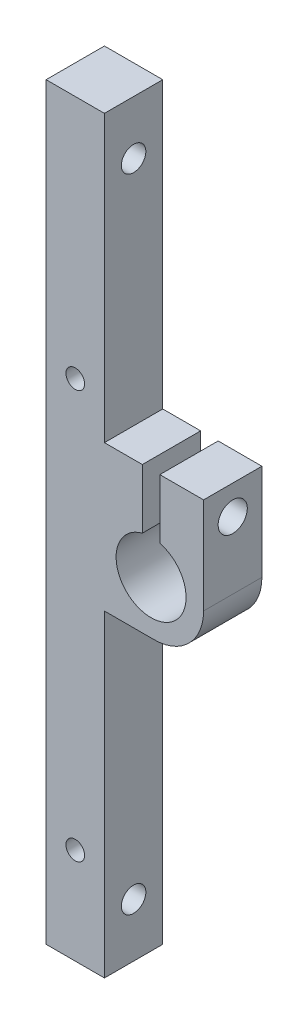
ISO-10303-21;
HEADER;
FILE_DESCRIPTION(('STEP AP214'),'2;1');
FILE_NAME('part.step','',(''),(''),'','','');
FILE_SCHEMA(('AUTOMOTIVE_DESIGN { 1 0 10303 214 1 1 1 1 }'));
ENDSEC;
DATA;
#1=APPLICATION_CONTEXT('core data for automotive mechanical design processes');
#2=APPLICATION_PROTOCOL_DEFINITION('international standard','automotive_design',2000,#1);
#3=PRODUCT_CONTEXT('',#1,'mechanical');
#4=PRODUCT('Part','Part','',(#3));
#5=PRODUCT_RELATED_PRODUCT_CATEGORY('part','',(#4));
#6=PRODUCT_DEFINITION_FORMATION('','',#4);
#7=PRODUCT_DEFINITION_CONTEXT('part definition',#1,'design');
#8=PRODUCT_DEFINITION('design','',#6,#7);
#9=PRODUCT_DEFINITION_SHAPE('','',#8);
#10=(LENGTH_UNIT() NAMED_UNIT(*) SI_UNIT(.MILLI.,.METRE.));
#11=(NAMED_UNIT(*) PLANE_ANGLE_UNIT() SI_UNIT($,.RADIAN.));
#12=(NAMED_UNIT(*) SI_UNIT($,.STERADIAN.) SOLID_ANGLE_UNIT());
#13=UNCERTAINTY_MEASURE_WITH_UNIT(LENGTH_MEASURE(1.E-05),#10,'distance_accuracy_value','');
#14=(GEOMETRIC_REPRESENTATION_CONTEXT(3) GLOBAL_UNCERTAINTY_ASSIGNED_CONTEXT((#13)) GLOBAL_UNIT_ASSIGNED_CONTEXT((#10,
#11,#12)) REPRESENTATION_CONTEXT('',''));
#15=CARTESIAN_POINT('',(0.,0.,0.));
#16=DIRECTION('',(0.,0.,1.));
#17=DIRECTION('',(1.,0.,0.));
#18=AXIS2_PLACEMENT_3D('',#15,#16,#17);
#19=CARTESIAN_POINT('',(10.,79.5,0.));
#20=DIRECTION('',(0.,1.,0.));
#21=DIRECTION('',(0.,0.,1.));
#22=AXIS2_PLACEMENT_3D('',#19,#20,#21);
#23=PLANE('',#22);
#24=DIRECTION('',(0.,0.,1.));
#25=VECTOR('',#24,1.);
#26=CARTESIAN_POINT('',(16.5,79.5,0.));
#27=LINE('',#26,#25);
#28=CARTESIAN_POINT('',(16.5,79.5,0.));
#29=VERTEX_POINT('',#28);
#30=CARTESIAN_POINT('',(16.5,79.5,10.));
#31=VERTEX_POINT('',#30);
#32=EDGE_CURVE('E283',#29,#31,#27,.T.);
#33=ORIENTED_EDGE('',*,*,#32,.F.);
#34=DIRECTION('',(-1.,0.,0.));
#35=VECTOR('',#34,1.);
#36=CARTESIAN_POINT('',(10.,79.5,0.));
#37=LINE('',#36,#35);
#38=CARTESIAN_POINT('',(10.,79.5,0.));
#39=VERTEX_POINT('',#38);
#40=EDGE_CURVE('E205',#29,#39,#37,.T.);
#41=ORIENTED_EDGE('',*,*,#40,.T.);
#42=DIRECTION('',(0.,0.,1.));
#43=VECTOR('',#42,1.);
#44=CARTESIAN_POINT('',(10.,79.5,0.));
#45=LINE('',#44,#43);
#46=CARTESIAN_POINT('',(10.,79.5,10.));
#47=VERTEX_POINT('',#46);
#48=EDGE_CURVE('E227',#39,#47,#45,.T.);
#49=ORIENTED_EDGE('',*,*,#48,.T.);
#50=DIRECTION('',(-1.,0.,0.));
#51=VECTOR('',#50,1.);
#52=CARTESIAN_POINT('',(10.,79.5,10.));
#53=LINE('',#52,#51);
#54=EDGE_CURVE('E201',#31,#47,#53,.T.);
#55=ORIENTED_EDGE('',*,*,#54,.F.);
#56=EDGE_LOOP('',(#33,#41,#49,#55));
#57=FACE_BOUND('',#56,.T.);
#58=ADVANCED_FACE('F35',(#57),#23,.T.);
#59=CARTESIAN_POINT('',(10.,0.,10.));
#60=DIRECTION('',(-1.,0.,0.));
#61=DIRECTION('',(0.,0.,1.));
#62=AXIS2_PLACEMENT_3D('',#59,#60,#61);
#63=PLANE('',#62);
#64=CARTESIAN_POINT('',(10.,119.2,5.));
#65=DIRECTION('',(1.,0.,0.));
#66=DIRECTION('',(0.,0.,-1.));
#67=AXIS2_PLACEMENT_3D('',#64,#65,#66);
#68=CIRCLE('',#67,2.1);
#69=CARTESIAN_POINT('',(10.,119.2,2.9));
#70=VERTEX_POINT('',#69);
#71=EDGE_CURVE('E230',#70,#70,#68,.T.);
#72=ORIENTED_EDGE('',*,*,#71,.F.);
#73=EDGE_LOOP('',(#72));
#74=FACE_BOUND('',#73,.T.);
#75=DIRECTION('',(0.,1.,0.));
#76=VECTOR('',#75,1.);
#77=CARTESIAN_POINT('',(10.,0.,0.));
#78=LINE('',#77,#76);
#79=CARTESIAN_POINT('',(10.,128.4,0.));
#80=VERTEX_POINT('',#79);
#81=EDGE_CURVE('E153',#39,#80,#78,.T.);
#82=ORIENTED_EDGE('',*,*,#81,.T.);
#83=DIRECTION('',(0.,0.,1.));
#84=VECTOR('',#83,1.);
#85=CARTESIAN_POINT('',(10.,128.4,10.));
#86=LINE('',#85,#84);
#87=CARTESIAN_POINT('',(10.,128.4,10.));
#88=VERTEX_POINT('',#87);
#89=EDGE_CURVE('E49',#80,#88,#86,.T.);
#90=ORIENTED_EDGE('',*,*,#89,.T.);
#91=DIRECTION('',(0.,1.,0.));
#92=VECTOR('',#91,1.);
#93=CARTESIAN_POINT('',(10.,0.,10.));
#94=LINE('',#93,#92);
#95=EDGE_CURVE('E141',#47,#88,#94,.T.);
#96=ORIENTED_EDGE('',*,*,#95,.F.);
#97=ORIENTED_EDGE('',*,*,#48,.F.);
#98=EDGE_LOOP('',(#82,#90,#96,#97));
#99=FACE_BOUND('',#98,.T.);
#100=ADVANCED_FACE('F256',(#74,#99),#63,.F.);
#101=CARTESIAN_POINT('',(0.,0.,10.));
#102=DIRECTION('',(1.,0.,0.));
#103=DIRECTION('',(0.,0.,-1.));
#104=AXIS2_PLACEMENT_3D('',#101,#102,#103);
#105=PLANE('',#104);
#106=CARTESIAN_POINT('',(0.,74.5,5.));
#107=DIRECTION('',(1.,0.,0.));
#108=DIRECTION('',(0.,0.,-1.));
#109=AXIS2_PLACEMENT_3D('',#106,#107,#108);
#110=CIRCLE('',#109,1.60000000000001);
#111=CARTESIAN_POINT('',(0.,74.5,3.39999999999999));
#112=VERTEX_POINT('',#111);
#113=EDGE_CURVE('E296',#112,#112,#110,.T.);
#114=ORIENTED_EDGE('',*,*,#113,.T.);
#115=EDGE_LOOP('',(#114));
#116=FACE_BOUND('',#115,.T.);
#117=CARTESIAN_POINT('',(0.,119.2,5.));
#118=DIRECTION('',(1.,0.,0.));
#119=DIRECTION('',(0.,0.,-1.));
#120=AXIS2_PLACEMENT_3D('',#117,#118,#119);
#121=CIRCLE('',#120,2.1);
#122=CARTESIAN_POINT('',(0.,119.2,2.9));
#123=VERTEX_POINT('',#122);
#124=EDGE_CURVE('E238',#123,#123,#121,.T.);
#125=ORIENTED_EDGE('',*,*,#124,.T.);
#126=EDGE_LOOP('',(#125));
#127=FACE_BOUND('',#126,.T.);
#128=CARTESIAN_POINT('',(0.,9.2,5.));
#129=DIRECTION('',(1.,0.,0.));
#130=DIRECTION('',(0.,0.,-1.));
#131=AXIS2_PLACEMENT_3D('',#128,#129,#130);
#132=CIRCLE('',#131,2.1);
#133=CARTESIAN_POINT('',(0.,9.2,2.9));
#134=VERTEX_POINT('',#133);
#135=EDGE_CURVE('E242',#134,#134,#132,.T.);
#136=ORIENTED_EDGE('',*,*,#135,.T.);
#137=EDGE_LOOP('',(#136));
#138=FACE_BOUND('',#137,.T.);
#139=DIRECTION('',(0.,-1.,0.));
#140=VECTOR('',#139,1.);
#141=CARTESIAN_POINT('',(0.,0.,10.));
#142=LINE('',#141,#140);
#143=CARTESIAN_POINT('',(0.,128.4,10.));
#144=VERTEX_POINT('',#143);
#145=CARTESIAN_POINT('',(0.,0.,10.));
#146=VERTEX_POINT('',#145);
#147=EDGE_CURVE('E138',#144,#146,#142,.T.);
#148=ORIENTED_EDGE('',*,*,#147,.F.);
#149=DIRECTION('',(0.,0.,-1.));
#150=VECTOR('',#149,1.);
#151=CARTESIAN_POINT('',(0.,128.4,10.));
#152=LINE('',#151,#150);
#153=CARTESIAN_POINT('',(0.,128.4,0.));
#154=VERTEX_POINT('',#153);
#155=EDGE_CURVE('E127',#144,#154,#152,.T.);
#156=ORIENTED_EDGE('',*,*,#155,.T.);
#157=DIRECTION('',(0.,-1.,0.));
#158=VECTOR('',#157,1.);
#159=CARTESIAN_POINT('',(0.,0.,0.));
#160=LINE('',#159,#158);
#161=CARTESIAN_POINT('',(0.,0.,0.));
#162=VERTEX_POINT('',#161);
#163=EDGE_CURVE('E161',#154,#162,#160,.T.);
#164=ORIENTED_EDGE('',*,*,#163,.T.);
#165=DIRECTION('',(0.,0.,-1.));
#166=VECTOR('',#165,1.);
#167=CARTESIAN_POINT('',(0.,0.,10.));
#168=LINE('',#167,#166);
#169=EDGE_CURVE('E147',#146,#162,#168,.T.);
#170=ORIENTED_EDGE('',*,*,#169,.F.);
#171=EDGE_LOOP('',(#148,#156,#164,#170));
#172=FACE_BOUND('',#171,.T.);
#173=ADVANCED_FACE('F145',(#116,#127,#138,#172),#105,.F.);
#174=CARTESIAN_POINT('',(0.,0.,10.));
#175=DIRECTION('',(0.,1.,0.));
#176=DIRECTION('',(0.,0.,1.));
#177=AXIS2_PLACEMENT_3D('',#174,#175,#176);
#178=PLANE('',#177);
#179=DIRECTION('',(1.,0.,0.));
#180=VECTOR('',#179,1.);
#181=CARTESIAN_POINT('',(0.,0.,0.));
#182=LINE('',#181,#180);
#183=CARTESIAN_POINT('',(10.,0.,0.));
#184=VERTEX_POINT('',#183);
#185=EDGE_CURVE('E173',#162,#184,#182,.T.);
#186=ORIENTED_EDGE('',*,*,#185,.T.);
#187=DIRECTION('',(0.,0.,-1.));
#188=VECTOR('',#187,1.);
#189=CARTESIAN_POINT('',(10.,0.,10.));
#190=LINE('',#189,#188);
#191=CARTESIAN_POINT('',(10.,0.,10.));
#192=VERTEX_POINT('',#191);
#193=EDGE_CURVE('E170',#192,#184,#190,.T.);
#194=ORIENTED_EDGE('',*,*,#193,.F.);
#195=DIRECTION('',(1.,0.,0.));
#196=VECTOR('',#195,1.);
#197=CARTESIAN_POINT('',(0.,0.,10.));
#198=LINE('',#197,#196);
#199=EDGE_CURVE('E148',#146,#192,#198,.T.);
#200=ORIENTED_EDGE('',*,*,#199,.F.);
#201=ORIENTED_EDGE('',*,*,#169,.T.);
#202=EDGE_LOOP('',(#186,#194,#200,#201));
#203=FACE_BOUND('',#202,.T.);
#204=ADVANCED_FACE('F254',(#203),#178,.F.);
#205=CARTESIAN_POINT('',(10.,9.2,5.));
#206=DIRECTION('',(1.,0.,0.));
#207=DIRECTION('',(0.,0.,-1.));
#208=AXIS2_PLACEMENT_3D('',#205,#206,#207);
#209=CIRCLE('',#208,2.1);
#210=CARTESIAN_POINT('',(10.,9.2,2.9));
#211=VERTEX_POINT('',#210);
#212=EDGE_CURVE('E156',#211,#211,#209,.T.);
#213=ORIENTED_EDGE('',*,*,#212,.F.);
#214=EDGE_LOOP('',(#213));
#215=FACE_BOUND('',#214,.T.);
#216=CARTESIAN_POINT('',(10.,54.5,0.));
#217=VERTEX_POINT('',#216);
#218=EDGE_CURVE('E149',#184,#217,#78,.T.);
#219=ORIENTED_EDGE('',*,*,#218,.T.);
#220=DIRECTION('',(0.,0.,1.));
#221=VECTOR('',#220,1.);
#222=CARTESIAN_POINT('',(10.,54.5,0.));
#223=LINE('',#222,#221);
#224=CARTESIAN_POINT('',(10.,54.5,10.));
#225=VERTEX_POINT('',#224);
#226=EDGE_CURVE('E223',#217,#225,#223,.T.);
#227=ORIENTED_EDGE('',*,*,#226,.T.);
#228=EDGE_CURVE('E167',#192,#225,#94,.T.);
#229=ORIENTED_EDGE('',*,*,#228,.F.);
#230=ORIENTED_EDGE('',*,*,#193,.T.);
#231=EDGE_LOOP('',(#219,#227,#229,#230));
#232=FACE_BOUND('',#231,.T.);
#233=ADVANCED_FACE('F251',(#215,#232),#63,.F.);
#234=CARTESIAN_POINT('',(0.,0.,10.));
#235=DIRECTION('',(0.,0.,-1.));
#236=DIRECTION('',(-1.,0.,0.));
#237=AXIS2_PLACEMENT_3D('',#234,#235,#236);
#238=PLANE('',#237);
#239=CARTESIAN_POINT('',(5.,16.5,10.));
#240=DIRECTION('',(0.,0.,-1.));
#241=DIRECTION('',(-1.,0.,0.));
#242=AXIS2_PLACEMENT_3D('',#239,#240,#241);
#243=CIRCLE('',#242,1.6);
#244=CARTESIAN_POINT('',(3.4,16.5,10.));
#245=VERTEX_POINT('',#244);
#246=EDGE_CURVE('E311',#245,#245,#243,.T.);
#247=ORIENTED_EDGE('',*,*,#246,.T.);
#248=EDGE_LOOP('',(#247));
#249=FACE_BOUND('',#248,.T.);
#250=CARTESIAN_POINT('',(5.,86.5,10.));
#251=DIRECTION('',(0.,0.,-1.));
#252=DIRECTION('',(-1.,0.,0.));
#253=AXIS2_PLACEMENT_3D('',#250,#251,#252);
#254=CIRCLE('',#253,1.6);
#255=CARTESIAN_POINT('',(3.4,86.5,10.));
#256=VERTEX_POINT('',#255);
#257=EDGE_CURVE('E142',#256,#256,#254,.T.);
#258=ORIENTED_EDGE('',*,*,#257,.T.);
#259=EDGE_LOOP('',(#258));
#260=FACE_BOUND('',#259,.T.);
#261=ORIENTED_EDGE('',*,*,#95,.T.);
#262=DIRECTION('',(1.,0.,0.));
#263=VECTOR('',#262,1.);
#264=CARTESIAN_POINT('',(-16.9644174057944,128.4,10.));
#265=LINE('',#264,#263);
#266=EDGE_CURVE('E130',#144,#88,#265,.T.);
#267=ORIENTED_EDGE('',*,*,#266,.F.);
#268=ORIENTED_EDGE('',*,*,#147,.T.);
#269=ORIENTED_EDGE('',*,*,#199,.T.);
#270=ORIENTED_EDGE('',*,*,#228,.T.);
#271=DIRECTION('',(1.,0.,0.));
#272=VECTOR('',#271,1.);
#273=CARTESIAN_POINT('',(10.,54.5,10.));
#274=LINE('',#273,#272);
#275=CARTESIAN_POINT('',(18.5,54.5,10.));
#276=VERTEX_POINT('',#275);
#277=EDGE_CURVE('E270',#225,#276,#274,.T.);
#278=ORIENTED_EDGE('',*,*,#277,.T.);
#279=CARTESIAN_POINT('',(18.5,63.,10.));
#280=DIRECTION('',(0.,0.,-1.));
#281=DIRECTION('',(-1.,0.,0.));
#282=AXIS2_PLACEMENT_3D('',#279,#280,#281);
#283=CIRCLE('',#282,8.5);
#284=CARTESIAN_POINT('',(27.,63.,10.));
#285=VERTEX_POINT('',#284);
#286=EDGE_CURVE('E182',#276,#285,#283,.F.);
#287=ORIENTED_EDGE('',*,*,#286,.T.);
#288=DIRECTION('',(0.,1.,0.));
#289=VECTOR('',#288,1.);
#290=CARTESIAN_POINT('',(27.,79.5,10.));
#291=LINE('',#290,#289);
#292=CARTESIAN_POINT('',(27.,79.5,10.));
#293=VERTEX_POINT('',#292);
#294=EDGE_CURVE('E204',#285,#293,#291,.T.);
#295=ORIENTED_EDGE('',*,*,#294,.T.);
#296=CARTESIAN_POINT('',(19.5,79.5,10.));
#297=VERTEX_POINT('',#296);
#298=EDGE_CURVE('E203',#293,#297,#53,.T.);
#299=ORIENTED_EDGE('',*,*,#298,.T.);
#300=DIRECTION('',(0.,1.,0.));
#301=VECTOR('',#300,1.);
#302=CARTESIAN_POINT('',(19.5,64.4578275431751,10.));
#303=LINE('',#302,#301);
#304=CARTESIAN_POINT('',(19.5,69.3094750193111,10.));
#305=VERTEX_POINT('',#304);
#306=EDGE_CURVE('E293',#305,#297,#303,.T.);
#307=ORIENTED_EDGE('',*,*,#306,.F.);
#308=CARTESIAN_POINT('',(18.,63.5,10.));
#309=DIRECTION('',(0.,0.,1.));
#310=DIRECTION('',(1.,0.,0.));
#311=AXIS2_PLACEMENT_3D('',#308,#309,#310);
#312=CIRCLE('',#311,6.00000000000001);
#313=CARTESIAN_POINT('',(16.5,69.3094750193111,10.));
#314=VERTEX_POINT('',#313);
#315=EDGE_CURVE('E276',#314,#305,#312,.T.);
#316=ORIENTED_EDGE('',*,*,#315,.F.);
#317=DIRECTION('',(0.,-1.,0.));
#318=VECTOR('',#317,1.);
#319=CARTESIAN_POINT('',(16.5,64.4578275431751,10.));
#320=LINE('',#319,#318);
#321=EDGE_CURVE('E57',#31,#314,#320,.T.);
#322=ORIENTED_EDGE('',*,*,#321,.F.);
#323=ORIENTED_EDGE('',*,*,#54,.T.);
#324=EDGE_LOOP('',(#261,#267,#268,#269,#270,#278,#287,#295,#299,#307,#316,#322,#323));
#325=FACE_BOUND('',#324,.T.);
#326=ADVANCED_FACE('F137',(#249,#260,#325),#238,.F.);
#327=CARTESIAN_POINT('',(0.,0.,0.));
#328=DIRECTION('',(0.,0.,-1.));
#329=DIRECTION('',(-1.,0.,0.));
#330=AXIS2_PLACEMENT_3D('',#327,#328,#329);
#331=PLANE('',#330);
#332=CARTESIAN_POINT('',(5.,16.5,0.));
#333=DIRECTION('',(0.,0.,-1.));
#334=DIRECTION('',(-1.,0.,0.));
#335=AXIS2_PLACEMENT_3D('',#332,#333,#334);
#336=CIRCLE('',#335,1.6);
#337=CARTESIAN_POINT('',(3.4,16.5,0.));
#338=VERTEX_POINT('',#337);
#339=EDGE_CURVE('E314',#338,#338,#336,.T.);
#340=ORIENTED_EDGE('',*,*,#339,.F.);
#341=EDGE_LOOP('',(#340));
#342=FACE_BOUND('',#341,.T.);
#343=CARTESIAN_POINT('',(5.,86.5,0.));
#344=DIRECTION('',(0.,0.,-1.));
#345=DIRECTION('',(-1.,0.,0.));
#346=AXIS2_PLACEMENT_3D('',#343,#344,#345);
#347=CIRCLE('',#346,1.6);
#348=CARTESIAN_POINT('',(3.4,86.5,0.));
#349=VERTEX_POINT('',#348);
#350=EDGE_CURVE('E308',#349,#349,#347,.T.);
#351=ORIENTED_EDGE('',*,*,#350,.F.);
#352=EDGE_LOOP('',(#351));
#353=FACE_BOUND('',#352,.T.);
#354=DIRECTION('',(-1.,0.,0.));
#355=VECTOR('',#354,1.);
#356=CARTESIAN_POINT('',(0.,128.4,0.));
#357=LINE('',#356,#355);
#358=EDGE_CURVE('E11',#80,#154,#357,.T.);
#359=ORIENTED_EDGE('',*,*,#358,.F.);
#360=ORIENTED_EDGE('',*,*,#81,.F.);
#361=ORIENTED_EDGE('',*,*,#40,.F.);
#362=DIRECTION('',(0.,1.,0.));
#363=VECTOR('',#362,1.);
#364=CARTESIAN_POINT('',(16.5,0.,0.));
#365=LINE('',#364,#363);
#366=CARTESIAN_POINT('',(16.5,69.3094750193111,0.));
#367=VERTEX_POINT('',#366);
#368=EDGE_CURVE('E287',#367,#29,#365,.T.);
#369=ORIENTED_EDGE('',*,*,#368,.F.);
#370=CARTESIAN_POINT('',(18.,63.5,0.));
#371=DIRECTION('',(0.,0.,1.));
#372=DIRECTION('',(1.,0.,0.));
#373=AXIS2_PLACEMENT_3D('',#370,#371,#372);
#374=CIRCLE('',#373,6.00000000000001);
#375=CARTESIAN_POINT('',(19.5,69.3094750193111,0.));
#376=VERTEX_POINT('',#375);
#377=EDGE_CURVE('E274',#367,#376,#374,.T.);
#378=ORIENTED_EDGE('',*,*,#377,.T.);
#379=DIRECTION('',(0.,-1.,0.));
#380=VECTOR('',#379,1.);
#381=CARTESIAN_POINT('',(19.5,0.,0.));
#382=LINE('',#381,#380);
#383=CARTESIAN_POINT('',(19.5,79.5,0.));
#384=VERTEX_POINT('',#383);
#385=EDGE_CURVE('E291',#384,#376,#382,.T.);
#386=ORIENTED_EDGE('',*,*,#385,.F.);
#387=CARTESIAN_POINT('',(27.,79.5,0.));
#388=VERTEX_POINT('',#387);
#389=EDGE_CURVE('E207',#388,#384,#37,.T.);
#390=ORIENTED_EDGE('',*,*,#389,.F.);
#391=DIRECTION('',(0.,1.,0.));
#392=VECTOR('',#391,1.);
#393=CARTESIAN_POINT('',(27.,79.5,0.));
#394=LINE('',#393,#392);
#395=CARTESIAN_POINT('',(27.,63.,0.));
#396=VERTEX_POINT('',#395);
#397=EDGE_CURVE('E208',#396,#388,#394,.T.);
#398=ORIENTED_EDGE('',*,*,#397,.F.);
#399=CARTESIAN_POINT('',(18.5,63.,0.));
#400=DIRECTION('',(0.,0.,-1.));
#401=DIRECTION('',(-1.,0.,0.));
#402=AXIS2_PLACEMENT_3D('',#399,#400,#401);
#403=CIRCLE('',#402,8.5);
#404=CARTESIAN_POINT('',(18.5,54.5,0.));
#405=VERTEX_POINT('',#404);
#406=EDGE_CURVE('E195',#396,#405,#403,.T.);
#407=ORIENTED_EDGE('',*,*,#406,.T.);
#408=DIRECTION('',(1.,0.,0.));
#409=VECTOR('',#408,1.);
#410=CARTESIAN_POINT('',(10.,54.5,0.));
#411=LINE('',#410,#409);
#412=EDGE_CURVE('E215',#217,#405,#411,.T.);
#413=ORIENTED_EDGE('',*,*,#412,.F.);
#414=ORIENTED_EDGE('',*,*,#218,.F.);
#415=ORIENTED_EDGE('',*,*,#185,.F.);
#416=ORIENTED_EDGE('',*,*,#163,.F.);
#417=EDGE_LOOP('',(#359,#360,#361,#369,#378,#386,#390,#398,#407,#413,#414,#415,#416));
#418=FACE_BOUND('',#417,.T.);
#419=ADVANCED_FACE('F263',(#342,#353,#418),#331,.T.);
#420=CARTESIAN_POINT('',(0.,9.2,5.));
#421=DIRECTION('',(1.,0.,0.));
#422=DIRECTION('',(0.,0.,-1.));
#423=AXIS2_PLACEMENT_3D('',#420,#421,#422);
#424=CYLINDRICAL_SURFACE('',#423,2.1);
#425=ORIENTED_EDGE('',*,*,#135,.F.);
#426=EDGE_LOOP('',(#425));
#427=FACE_BOUND('',#426,.T.);
#428=ORIENTED_EDGE('',*,*,#212,.T.);
#429=EDGE_LOOP('',(#428));
#430=FACE_BOUND('',#429,.T.);
#431=ADVANCED_FACE('F249',(#427,#430),#424,.F.);
#432=CARTESIAN_POINT('',(0.,119.2,5.));
#433=DIRECTION('',(1.,0.,0.));
#434=DIRECTION('',(0.,0.,-1.));
#435=AXIS2_PLACEMENT_3D('',#432,#433,#434);
#436=CYLINDRICAL_SURFACE('',#435,2.1);
#437=ORIENTED_EDGE('',*,*,#124,.F.);
#438=EDGE_LOOP('',(#437));
#439=FACE_BOUND('',#438,.T.);
#440=ORIENTED_EDGE('',*,*,#71,.T.);
#441=EDGE_LOOP('',(#440));
#442=FACE_BOUND('',#441,.T.);
#443=ADVANCED_FACE('F350',(#439,#442),#436,.F.);
#444=DIRECTION('',(0.,0.,-1.));
#445=VECTOR('',#444,1.);
#446=CARTESIAN_POINT('',(19.5,79.5,0.));
#447=LINE('',#446,#445);
#448=EDGE_CURVE('E289',#297,#384,#447,.T.);
#449=ORIENTED_EDGE('',*,*,#448,.F.);
#450=ORIENTED_EDGE('',*,*,#298,.F.);
#451=DIRECTION('',(0.,0.,1.));
#452=VECTOR('',#451,1.);
#453=CARTESIAN_POINT('',(27.,79.5,0.));
#454=LINE('',#453,#452);
#455=EDGE_CURVE('E231',#388,#293,#454,.T.);
#456=ORIENTED_EDGE('',*,*,#455,.F.);
#457=ORIENTED_EDGE('',*,*,#389,.T.);
#458=EDGE_LOOP('',(#449,#450,#456,#457));
#459=FACE_BOUND('',#458,.T.);
#460=ADVANCED_FACE('F341',(#459),#23,.T.);
#461=CARTESIAN_POINT('',(27.,79.5,0.));
#462=DIRECTION('',(1.,0.,0.));
#463=DIRECTION('',(0.,1.,0.));
#464=AXIS2_PLACEMENT_3D('',#461,#462,#463);
#465=PLANE('',#464);
#466=CARTESIAN_POINT('',(27.,74.5,5.));
#467=DIRECTION('',(1.,0.,0.));
#468=DIRECTION('',(0.,1.,0.));
#469=AXIS2_PLACEMENT_3D('',#466,#467,#468);
#470=CIRCLE('',#469,2.5);
#471=CARTESIAN_POINT('',(27.,77.,5.));
#472=VERTEX_POINT('',#471);
#473=EDGE_CURVE('E302',#472,#472,#470,.T.);
#474=ORIENTED_EDGE('',*,*,#473,.F.);
#475=EDGE_LOOP('',(#474));
#476=FACE_BOUND('',#475,.T.);
#477=ORIENTED_EDGE('',*,*,#294,.F.);
#478=DIRECTION('',(0.,0.,1.));
#479=VECTOR('',#478,1.);
#480=CARTESIAN_POINT('',(27.,63.,0.));
#481=LINE('',#480,#479);
#482=EDGE_CURVE('E188',#285,#396,#481,.F.);
#483=ORIENTED_EDGE('',*,*,#482,.T.);
#484=ORIENTED_EDGE('',*,*,#397,.T.);
#485=ORIENTED_EDGE('',*,*,#455,.T.);
#486=EDGE_LOOP('',(#477,#483,#484,#485));
#487=FACE_BOUND('',#486,.T.);
#488=ADVANCED_FACE('F272',(#476,#487),#465,.T.);
#489=CARTESIAN_POINT('',(10.,54.5,0.));
#490=DIRECTION('',(0.,-1.,0.));
#491=DIRECTION('',(0.,0.,-1.));
#492=AXIS2_PLACEMENT_3D('',#489,#490,#491);
#493=PLANE('',#492);
#494=ORIENTED_EDGE('',*,*,#412,.T.);
#495=DIRECTION('',(0.,0.,1.));
#496=VECTOR('',#495,1.);
#497=CARTESIAN_POINT('',(18.5,54.5,0.));
#498=LINE('',#497,#496);
#499=EDGE_CURVE('E179',#405,#276,#498,.T.);
#500=ORIENTED_EDGE('',*,*,#499,.T.);
#501=ORIENTED_EDGE('',*,*,#277,.F.);
#502=ORIENTED_EDGE('',*,*,#226,.F.);
#503=EDGE_LOOP('',(#494,#500,#501,#502));
#504=FACE_BOUND('',#503,.T.);
#505=ADVANCED_FACE('F356',(#504),#493,.T.);
#506=CARTESIAN_POINT('',(18.,63.5,0.));
#507=DIRECTION('',(0.,0.,1.));
#508=DIRECTION('',(1.,0.,0.));
#509=AXIS2_PLACEMENT_3D('',#506,#507,#508);
#510=CYLINDRICAL_SURFACE('',#509,6.00000000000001);
#511=ORIENTED_EDGE('',*,*,#377,.F.);
#512=DIRECTION('',(0.,0.,1.));
#513=VECTOR('',#512,1.);
#514=CARTESIAN_POINT('',(16.5,69.3094750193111,0.));
#515=LINE('',#514,#513);
#516=EDGE_CURVE('E43',#367,#314,#515,.T.);
#517=ORIENTED_EDGE('',*,*,#516,.T.);
#518=ORIENTED_EDGE('',*,*,#315,.T.);
#519=DIRECTION('',(0.,0.,1.));
#520=VECTOR('',#519,1.);
#521=CARTESIAN_POINT('',(19.5,69.3094750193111,0.));
#522=LINE('',#521,#520);
#523=EDGE_CURVE('E197',#305,#376,#522,.F.);
#524=ORIENTED_EDGE('',*,*,#523,.T.);
#525=EDGE_LOOP('',(#511,#517,#518,#524));
#526=FACE_BOUND('',#525,.T.);
#527=ADVANCED_FACE('F366',(#526),#510,.F.);
#528=CARTESIAN_POINT('',(18.5,63.,0.));
#529=DIRECTION('',(0.,0.,1.));
#530=DIRECTION('',(1.,0.,0.));
#531=AXIS2_PLACEMENT_3D('',#528,#529,#530);
#532=CYLINDRICAL_SURFACE('',#531,8.5);
#533=ORIENTED_EDGE('',*,*,#406,.F.);
#534=ORIENTED_EDGE('',*,*,#482,.F.);
#535=ORIENTED_EDGE('',*,*,#286,.F.);
#536=ORIENTED_EDGE('',*,*,#499,.F.);
#537=EDGE_LOOP('',(#533,#534,#535,#536));
#538=FACE_BOUND('',#537,.T.);
#539=ADVANCED_FACE('F37',(#538),#532,.T.);
#540=CARTESIAN_POINT('',(19.5,64.4578275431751,-4.99999999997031E-05));
#541=DIRECTION('',(1.,0.,0.));
#542=DIRECTION('',(0.,0.,-1.));
#543=AXIS2_PLACEMENT_3D('',#540,#541,#542);
#544=PLANE('',#543);
#545=CARTESIAN_POINT('',(19.5,74.5,5.));
#546=DIRECTION('',(1.,0.,0.));
#547=DIRECTION('',(0.,0.,-1.));
#548=AXIS2_PLACEMENT_3D('',#545,#546,#547);
#549=CIRCLE('',#548,2.5);
#550=CARTESIAN_POINT('',(19.5,74.5,2.5));
#551=VERTEX_POINT('',#550);
#552=EDGE_CURVE('E299',#551,#551,#549,.F.);
#553=ORIENTED_EDGE('',*,*,#552,.F.);
#554=EDGE_LOOP('',(#553));
#555=FACE_BOUND('',#554,.T.);
#556=ORIENTED_EDGE('',*,*,#448,.T.);
#557=ORIENTED_EDGE('',*,*,#385,.T.);
#558=ORIENTED_EDGE('',*,*,#523,.F.);
#559=ORIENTED_EDGE('',*,*,#306,.T.);
#560=EDGE_LOOP('',(#556,#557,#558,#559));
#561=FACE_BOUND('',#560,.T.);
#562=ADVANCED_FACE('F363',(#555,#561),#544,.F.);
#563=CARTESIAN_POINT('',(16.5,64.4578275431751,-4.99999999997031E-05));
#564=DIRECTION('',(-1.,0.,0.));
#565=DIRECTION('',(0.,0.,1.));
#566=AXIS2_PLACEMENT_3D('',#563,#564,#565);
#567=PLANE('',#566);
#568=CARTESIAN_POINT('',(16.5,74.5,5.));
#569=DIRECTION('',(-1.,0.,0.));
#570=DIRECTION('',(0.,0.,1.));
#571=AXIS2_PLACEMENT_3D('',#568,#569,#570);
#572=CIRCLE('',#571,1.60000000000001);
#573=CARTESIAN_POINT('',(16.5,74.5,6.60000000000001));
#574=VERTEX_POINT('',#573);
#575=EDGE_CURVE('E209',#574,#574,#572,.T.);
#576=ORIENTED_EDGE('',*,*,#575,.T.);
#577=EDGE_LOOP('',(#576));
#578=FACE_BOUND('',#577,.T.);
#579=ORIENTED_EDGE('',*,*,#32,.T.);
#580=ORIENTED_EDGE('',*,*,#321,.T.);
#581=ORIENTED_EDGE('',*,*,#516,.F.);
#582=ORIENTED_EDGE('',*,*,#368,.T.);
#583=EDGE_LOOP('',(#579,#580,#581,#582));
#584=FACE_BOUND('',#583,.T.);
#585=ADVANCED_FACE('F367',(#578,#584),#567,.F.);
#586=CARTESIAN_POINT('',(-2.99999999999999,74.5,5.));
#587=DIRECTION('',(1.,0.,0.));
#588=DIRECTION('',(0.,1.,0.));
#589=AXIS2_PLACEMENT_3D('',#586,#587,#588);
#590=CYLINDRICAL_SURFACE('',#589,1.60000000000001);
#591=ORIENTED_EDGE('',*,*,#575,.F.);
#592=EDGE_LOOP('',(#591));
#593=FACE_BOUND('',#592,.T.);
#594=ORIENTED_EDGE('',*,*,#113,.F.);
#595=EDGE_LOOP('',(#594));
#596=FACE_BOUND('',#595,.T.);
#597=ADVANCED_FACE('F374',(#593,#596),#590,.F.);
#598=CARTESIAN_POINT('',(12.4289321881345,74.5,5.));
#599=DIRECTION('',(1.,0.,0.));
#600=DIRECTION('',(0.,1.,0.));
#601=AXIS2_PLACEMENT_3D('',#598,#599,#600);
#602=CYLINDRICAL_SURFACE('',#601,2.5);
#603=ORIENTED_EDGE('',*,*,#552,.T.);
#604=EDGE_LOOP('',(#603));
#605=FACE_BOUND('',#604,.T.);
#606=ORIENTED_EDGE('',*,*,#473,.T.);
#607=EDGE_LOOP('',(#606));
#608=FACE_BOUND('',#607,.T.);
#609=ADVANCED_FACE('F381',(#605,#608),#602,.F.);
#610=CARTESIAN_POINT('',(-16.9644174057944,128.4,0.));
#611=DIRECTION('',(0.,-1.,0.));
#612=DIRECTION('',(0.,0.,-1.));
#613=AXIS2_PLACEMENT_3D('',#610,#611,#612);
#614=PLANE('',#613);
#615=ORIENTED_EDGE('',*,*,#358,.T.);
#616=ORIENTED_EDGE('',*,*,#155,.F.);
#617=ORIENTED_EDGE('',*,*,#266,.T.);
#618=ORIENTED_EDGE('',*,*,#89,.F.);
#619=EDGE_LOOP('',(#615,#616,#617,#618));
#620=FACE_BOUND('',#619,.T.);
#621=ADVANCED_FACE('F129',(#620),#614,.F.);
#622=CARTESIAN_POINT('',(5.,86.5,10.00005));
#623=DIRECTION('',(0.,0.,-1.));
#624=DIRECTION('',(-1.,0.,0.));
#625=AXIS2_PLACEMENT_3D('',#622,#623,#624);
#626=CYLINDRICAL_SURFACE('',#625,1.6);
#627=ORIENTED_EDGE('',*,*,#350,.T.);
#628=EDGE_LOOP('',(#627));
#629=FACE_BOUND('',#628,.T.);
#630=ORIENTED_EDGE('',*,*,#257,.F.);
#631=EDGE_LOOP('',(#630));
#632=FACE_BOUND('',#631,.T.);
#633=ADVANCED_FACE('F326',(#629,#632),#626,.F.);
#634=CARTESIAN_POINT('',(5.,16.5,10.00005));
#635=DIRECTION('',(0.,0.,-1.));
#636=DIRECTION('',(-1.,0.,0.));
#637=AXIS2_PLACEMENT_3D('',#634,#635,#636);
#638=CYLINDRICAL_SURFACE('',#637,1.6);
#639=ORIENTED_EDGE('',*,*,#339,.T.);
#640=EDGE_LOOP('',(#639));
#641=FACE_BOUND('',#640,.T.);
#642=ORIENTED_EDGE('',*,*,#246,.F.);
#643=EDGE_LOOP('',(#642));
#644=FACE_BOUND('',#643,.T.);
#645=ADVANCED_FACE('F318',(#641,#644),#638,.F.);
#646=CLOSED_SHELL('',(#58,#100,#173,#204,#233,#326,#419,#431,#443,#460,#488,#505,#527,#539,#562,
#585,#597,#609,#621,#633,#645));
#647=MANIFOLD_SOLID_BREP('B2',#646);
#648=ADVANCED_BREP_SHAPE_REPRESENTATION('',(#18,#647),#14);
#649=SHAPE_DEFINITION_REPRESENTATION(#9,#648);
ENDSEC;
END-ISO-10303-21;
